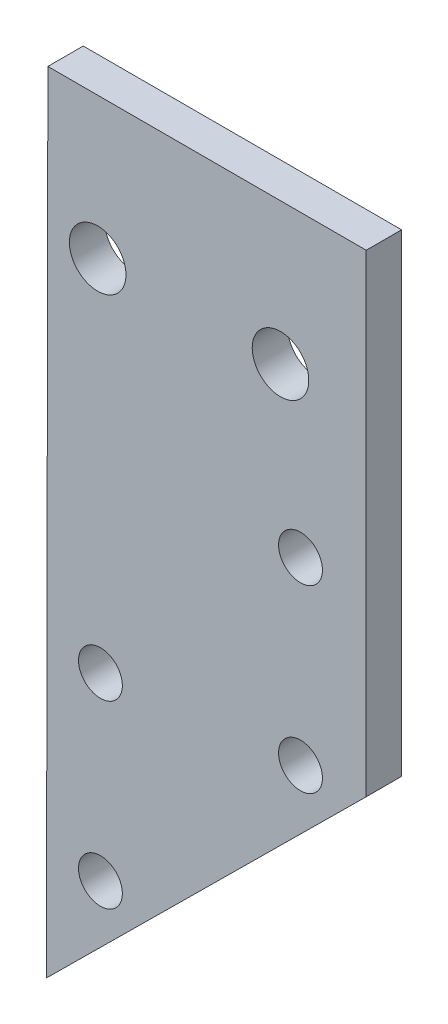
ISO-10303-21;
HEADER;
FILE_DESCRIPTION(('STEP AP214'),'2;1');
FILE_NAME('part.step','',(''),(''),'','','');
FILE_SCHEMA(('AUTOMOTIVE_DESIGN { 1 0 10303 214 1 1 1 1 }'));
ENDSEC;
DATA;
#1=APPLICATION_CONTEXT('core data for automotive mechanical design processes');
#2=APPLICATION_PROTOCOL_DEFINITION('international standard','automotive_design',2000,#1);
#3=PRODUCT_CONTEXT('',#1,'mechanical');
#4=PRODUCT('Part','Part','',(#3));
#5=PRODUCT_RELATED_PRODUCT_CATEGORY('part','',(#4));
#6=PRODUCT_DEFINITION_FORMATION('','',#4);
#7=PRODUCT_DEFINITION_CONTEXT('part definition',#1,'design');
#8=PRODUCT_DEFINITION('design','',#6,#7);
#9=PRODUCT_DEFINITION_SHAPE('','',#8);
#10=(LENGTH_UNIT() NAMED_UNIT(*) SI_UNIT(.MILLI.,.METRE.));
#11=(NAMED_UNIT(*) PLANE_ANGLE_UNIT() SI_UNIT($,.RADIAN.));
#12=(NAMED_UNIT(*) SI_UNIT($,.STERADIAN.) SOLID_ANGLE_UNIT());
#13=UNCERTAINTY_MEASURE_WITH_UNIT(LENGTH_MEASURE(1.E-05),#10,'distance_accuracy_value','');
#14=(GEOMETRIC_REPRESENTATION_CONTEXT(3) GLOBAL_UNCERTAINTY_ASSIGNED_CONTEXT((#13)) GLOBAL_UNIT_ASSIGNED_CONTEXT((#10,
#11,#12)) REPRESENTATION_CONTEXT('',''));
#15=CARTESIAN_POINT('',(0.,0.,0.));
#16=DIRECTION('',(0.,0.,1.));
#17=DIRECTION('',(1.,0.,0.));
#18=AXIS2_PLACEMENT_3D('',#15,#16,#17);
#19=CARTESIAN_POINT('',(0.,0.,0.));
#20=DIRECTION('',(0.,0.,1.));
#21=DIRECTION('',(1.,0.,0.));
#22=AXIS2_PLACEMENT_3D('',#19,#20,#21);
#23=PLANE('',#22);
#24=CARTESIAN_POINT('',(-142.668480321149,55.9735697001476,0.));
#25=DIRECTION('',(0.,0.,-1.));
#26=DIRECTION('',(-1.,0.,0.));
#27=AXIS2_PLACEMENT_3D('',#24,#25,#26);
#28=CIRCLE('',#27,3.09999999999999);
#29=CARTESIAN_POINT('',(-145.768480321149,55.9735697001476,0.));
#30=VERTEX_POINT('',#29);
#31=EDGE_CURVE('E99',#30,#30,#28,.F.);
#32=ORIENTED_EDGE('',*,*,#31,.T.);
#33=EDGE_LOOP('',(#32));
#34=FACE_BOUND('',#33,.T.);
#35=CARTESIAN_POINT('',(-170.952751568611,2.23345432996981,0.));
#36=DIRECTION('',(0.,0.,-1.));
#37=DIRECTION('',(-1.,0.,0.));
#38=AXIS2_PLACEMENT_3D('',#35,#36,#37);
#39=CIRCLE('',#38,3.09999999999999);
#40=CARTESIAN_POINT('',(-174.052751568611,2.23345432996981,0.));
#41=VERTEX_POINT('',#40);
#42=EDGE_CURVE('E102',#41,#41,#39,.F.);
#43=ORIENTED_EDGE('',*,*,#42,.T.);
#44=EDGE_LOOP('',(#43));
#45=FACE_BOUND('',#44,.T.);
#46=DIRECTION('',(-0.710399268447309,-0.703798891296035,0.));
#47=VECTOR('',#46,1.);
#48=CARTESIAN_POINT('',(-178.58737277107,-13.4664482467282,0.));
#49=LINE('',#48,#47);
#50=CARTESIAN_POINT('',(-133.382729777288,31.3181947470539,0.));
#51=VERTEX_POINT('',#50);
#52=CARTESIAN_POINT('',(-178.58737277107,-13.4664482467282,0.));
#53=VERTEX_POINT('',#52);
#54=EDGE_CURVE('E105',#51,#53,#49,.T.);
#55=ORIENTED_EDGE('',*,*,#54,.T.);
#56=DIRECTION('',(0.00183210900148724,0.999998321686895,0.));
#57=VECTOR('',#56,1.);
#58=CARTESIAN_POINT('',(-178.382729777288,98.2314093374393,0.));
#59=LINE('',#58,#57);
#60=CARTESIAN_POINT('',(-178.382729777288,98.2314093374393,0.));
#61=VERTEX_POINT('',#60);
#62=EDGE_CURVE('E72',#53,#61,#59,.T.);
#63=ORIENTED_EDGE('',*,*,#62,.T.);
#64=DIRECTION('',(1.,0.,0.));
#65=VECTOR('',#64,1.);
#66=CARTESIAN_POINT('',(-133.382729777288,98.2314093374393,0.));
#67=LINE('',#66,#65);
#68=CARTESIAN_POINT('',(-133.382729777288,98.2314093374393,0.));
#69=VERTEX_POINT('',#68);
#70=EDGE_CURVE('E55',#61,#69,#67,.T.);
#71=ORIENTED_EDGE('',*,*,#70,.T.);
#72=DIRECTION('',(0.,1.,0.));
#73=VECTOR('',#72,1.);
#74=CARTESIAN_POINT('',(-133.382729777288,31.3181947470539,0.));
#75=LINE('',#74,#73);
#76=EDGE_CURVE('E60',#69,#51,#75,.F.);
#77=ORIENTED_EDGE('',*,*,#76,.T.);
#78=EDGE_LOOP('',(#55,#63,#71,#77));
#79=FACE_BOUND('',#78,.T.);
#80=CARTESIAN_POINT('',(-170.952751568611,27.6892984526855,0.));
#81=DIRECTION('',(0.,0.,-1.));
#82=DIRECTION('',(-1.,0.,0.));
#83=AXIS2_PLACEMENT_3D('',#80,#81,#82);
#84=CIRCLE('',#83,3.09999999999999);
#85=CARTESIAN_POINT('',(-174.052751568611,27.6892984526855,0.));
#86=VERTEX_POINT('',#85);
#87=EDGE_CURVE('E69',#86,#86,#84,.F.);
#88=ORIENTED_EDGE('',*,*,#87,.T.);
#89=EDGE_LOOP('',(#88));
#90=FACE_BOUND('',#89,.T.);
#91=CARTESIAN_POINT('',(-142.668480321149,30.5177255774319,0.));
#92=DIRECTION('',(0.,0.,-1.));
#93=DIRECTION('',(-1.,0.,0.));
#94=AXIS2_PLACEMENT_3D('',#91,#92,#93);
#95=CIRCLE('',#94,3.09999999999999);
#96=CARTESIAN_POINT('',(-145.768480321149,30.5177255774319,0.));
#97=VERTEX_POINT('',#96);
#98=EDGE_CURVE('E108',#97,#97,#95,.F.);
#99=ORIENTED_EDGE('',*,*,#98,.T.);
#100=EDGE_LOOP('',(#99));
#101=FACE_BOUND('',#100,.T.);
#102=CARTESIAN_POINT('',(-171.341888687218,78.2314093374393,0.));
#103=DIRECTION('',(0.,0.,-1.));
#104=DIRECTION('',(-1.,0.,0.));
#105=AXIS2_PLACEMENT_3D('',#102,#103,#104);
#106=CIRCLE('',#105,4.);
#107=CARTESIAN_POINT('',(-175.341888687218,78.2314093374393,0.));
#108=VERTEX_POINT('',#107);
#109=EDGE_CURVE('E110',#108,#108,#106,.F.);
#110=ORIENTED_EDGE('',*,*,#109,.T.);
#111=EDGE_LOOP('',(#110));
#112=FACE_BOUND('',#111,.T.);
#113=CARTESIAN_POINT('',(-145.497823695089,78.2314093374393,0.));
#114=DIRECTION('',(0.,0.,-1.));
#115=DIRECTION('',(-1.,0.,0.));
#116=AXIS2_PLACEMENT_3D('',#113,#114,#115);
#117=CIRCLE('',#116,4.);
#118=CARTESIAN_POINT('',(-149.497823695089,78.2314093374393,0.));
#119=VERTEX_POINT('',#118);
#120=EDGE_CURVE('E20',#119,#119,#117,.F.);
#121=ORIENTED_EDGE('',*,*,#120,.T.);
#122=EDGE_LOOP('',(#121));
#123=FACE_BOUND('',#122,.T.);
#124=ADVANCED_FACE('F17',(#34,#45,#79,#90,#101,#112,#123),#23,.F.);
#125=CARTESIAN_POINT('',(-145.497823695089,78.2314093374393,5.));
#126=DIRECTION('',(0.,0.,-1.));
#127=DIRECTION('',(-1.,0.,0.));
#128=AXIS2_PLACEMENT_3D('',#125,#126,#127);
#129=CYLINDRICAL_SURFACE('',#128,4.);
#130=ORIENTED_EDGE('',*,*,#120,.F.);
#131=EDGE_LOOP('',(#130));
#132=FACE_BOUND('',#131,.T.);
#133=CARTESIAN_POINT('',(-145.497823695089,78.2314093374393,5.));
#134=DIRECTION('',(0.,0.,-1.));
#135=DIRECTION('',(-1.,0.,0.));
#136=AXIS2_PLACEMENT_3D('',#133,#134,#135);
#137=CIRCLE('',#136,4.);
#138=CARTESIAN_POINT('',(-149.497823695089,78.2314093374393,5.));
#139=VERTEX_POINT('',#138);
#140=EDGE_CURVE('E96',#139,#139,#137,.T.);
#141=ORIENTED_EDGE('',*,*,#140,.F.);
#142=EDGE_LOOP('',(#141));
#143=FACE_BOUND('',#142,.T.);
#144=ADVANCED_FACE('F118',(#132,#143),#129,.F.);
#145=CARTESIAN_POINT('',(-171.341888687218,78.2314093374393,5.));
#146=DIRECTION('',(0.,0.,-1.));
#147=DIRECTION('',(-1.,0.,0.));
#148=AXIS2_PLACEMENT_3D('',#145,#146,#147);
#149=CYLINDRICAL_SURFACE('',#148,4.);
#150=ORIENTED_EDGE('',*,*,#109,.F.);
#151=EDGE_LOOP('',(#150));
#152=FACE_BOUND('',#151,.T.);
#153=CARTESIAN_POINT('',(-171.341888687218,78.2314093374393,5.));
#154=DIRECTION('',(0.,0.,-1.));
#155=DIRECTION('',(-1.,0.,0.));
#156=AXIS2_PLACEMENT_3D('',#153,#154,#155);
#157=CIRCLE('',#156,4.);
#158=CARTESIAN_POINT('',(-175.341888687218,78.2314093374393,5.));
#159=VERTEX_POINT('',#158);
#160=EDGE_CURVE('E93',#159,#159,#157,.T.);
#161=ORIENTED_EDGE('',*,*,#160,.F.);
#162=EDGE_LOOP('',(#161));
#163=FACE_BOUND('',#162,.T.);
#164=ADVANCED_FACE('F121',(#152,#163),#149,.F.);
#165=CARTESIAN_POINT('',(-142.668480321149,30.5177255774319,5.));
#166=DIRECTION('',(0.,0.,-1.));
#167=DIRECTION('',(-1.,0.,0.));
#168=AXIS2_PLACEMENT_3D('',#165,#166,#167);
#169=CYLINDRICAL_SURFACE('',#168,3.09999999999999);
#170=CARTESIAN_POINT('',(-142.668480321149,30.5177255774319,5.));
#171=DIRECTION('',(0.,0.,-1.));
#172=DIRECTION('',(-1.,0.,0.));
#173=AXIS2_PLACEMENT_3D('',#170,#171,#172);
#174=CIRCLE('',#173,3.09999999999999);
#175=CARTESIAN_POINT('',(-145.768480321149,30.5177255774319,5.));
#176=VERTEX_POINT('',#175);
#177=EDGE_CURVE('E90',#176,#176,#174,.T.);
#178=ORIENTED_EDGE('',*,*,#177,.F.);
#179=EDGE_LOOP('',(#178));
#180=FACE_BOUND('',#179,.T.);
#181=ORIENTED_EDGE('',*,*,#98,.F.);
#182=EDGE_LOOP('',(#181));
#183=FACE_BOUND('',#182,.T.);
#184=ADVANCED_FACE('F155',(#180,#183),#169,.F.);
#185=CARTESIAN_POINT('',(-170.952751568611,27.6892984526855,5.));
#186=DIRECTION('',(0.,0.,-1.));
#187=DIRECTION('',(-1.,0.,0.));
#188=AXIS2_PLACEMENT_3D('',#185,#186,#187);
#189=CYLINDRICAL_SURFACE('',#188,3.09999999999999);
#190=CARTESIAN_POINT('',(-170.952751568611,27.6892984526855,5.));
#191=DIRECTION('',(0.,0.,-1.));
#192=DIRECTION('',(-1.,0.,0.));
#193=AXIS2_PLACEMENT_3D('',#190,#191,#192);
#194=CIRCLE('',#193,3.09999999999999);
#195=CARTESIAN_POINT('',(-174.052751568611,27.6892984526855,5.));
#196=VERTEX_POINT('',#195);
#197=EDGE_CURVE('E86',#196,#196,#194,.T.);
#198=ORIENTED_EDGE('',*,*,#197,.F.);
#199=EDGE_LOOP('',(#198));
#200=FACE_BOUND('',#199,.T.);
#201=ORIENTED_EDGE('',*,*,#87,.F.);
#202=EDGE_LOOP('',(#201));
#203=FACE_BOUND('',#202,.T.);
#204=ADVANCED_FACE('F152',(#200,#203),#189,.F.);
#205=CARTESIAN_POINT('',(-133.382729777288,31.3181947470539,5.));
#206=DIRECTION('',(-1.,0.,0.));
#207=DIRECTION('',(0.,0.,1.));
#208=AXIS2_PLACEMENT_3D('',#205,#206,#207);
#209=PLANE('',#208);
#210=DIRECTION('',(0.,0.,-1.));
#211=VECTOR('',#210,1.);
#212=CARTESIAN_POINT('',(-133.382729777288,98.2314093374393,5.));
#213=LINE('',#212,#211);
#214=CARTESIAN_POINT('',(-133.382729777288,98.2314093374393,5.));
#215=VERTEX_POINT('',#214);
#216=EDGE_CURVE('E62',#69,#215,#213,.F.);
#217=ORIENTED_EDGE('',*,*,#216,.T.);
#218=DIRECTION('',(0.,1.,0.));
#219=VECTOR('',#218,1.);
#220=CARTESIAN_POINT('',(-133.382729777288,0.,5.));
#221=LINE('',#220,#219);
#222=CARTESIAN_POINT('',(-133.382729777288,31.3181947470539,5.));
#223=VERTEX_POINT('',#222);
#224=EDGE_CURVE('E89',#223,#215,#221,.T.);
#225=ORIENTED_EDGE('',*,*,#224,.F.);
#226=DIRECTION('',(0.,0.,1.));
#227=VECTOR('',#226,1.);
#228=CARTESIAN_POINT('',(-133.382729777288,31.3181947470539,5.));
#229=LINE('',#228,#227);
#230=EDGE_CURVE('E65',#223,#51,#229,.F.);
#231=ORIENTED_EDGE('',*,*,#230,.T.);
#232=ORIENTED_EDGE('',*,*,#76,.F.);
#233=EDGE_LOOP('',(#217,#225,#231,#232));
#234=FACE_BOUND('',#233,.T.);
#235=ADVANCED_FACE('F61',(#234),#209,.F.);
#236=CARTESIAN_POINT('',(-133.382729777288,98.2314093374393,5.));
#237=DIRECTION('',(0.,-1.,0.));
#238=DIRECTION('',(0.,0.,-1.));
#239=AXIS2_PLACEMENT_3D('',#236,#237,#238);
#240=PLANE('',#239);
#241=DIRECTION('',(0.,0.,1.));
#242=VECTOR('',#241,1.);
#243=CARTESIAN_POINT('',(-178.382729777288,98.2314093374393,5.));
#244=LINE('',#243,#242);
#245=CARTESIAN_POINT('',(-178.382729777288,98.2314093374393,5.));
#246=VERTEX_POINT('',#245);
#247=EDGE_CURVE('E74',#61,#246,#244,.T.);
#248=ORIENTED_EDGE('',*,*,#247,.T.);
#249=DIRECTION('',(1.,0.,0.));
#250=VECTOR('',#249,1.);
#251=CARTESIAN_POINT('',(0.,98.2314093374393,5.));
#252=LINE('',#251,#250);
#253=EDGE_CURVE('E78',#215,#246,#252,.F.);
#254=ORIENTED_EDGE('',*,*,#253,.F.);
#255=ORIENTED_EDGE('',*,*,#216,.F.);
#256=ORIENTED_EDGE('',*,*,#70,.F.);
#257=EDGE_LOOP('',(#248,#254,#255,#256));
#258=FACE_BOUND('',#257,.T.);
#259=ADVANCED_FACE('F76',(#258),#240,.F.);
#260=CARTESIAN_POINT('',(-178.382729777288,98.2314093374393,5.));
#261=DIRECTION('',(0.999998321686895,-0.00183210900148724,0.));
#262=DIRECTION('',(0.00183210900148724,0.999998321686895,0.));
#263=AXIS2_PLACEMENT_3D('',#260,#261,#262);
#264=PLANE('',#263);
#265=DIRECTION('',(0.,0.,1.));
#266=VECTOR('',#265,1.);
#267=CARTESIAN_POINT('',(-178.58737277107,-13.4664482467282,5.));
#268=LINE('',#267,#266);
#269=CARTESIAN_POINT('',(-178.58737277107,-13.4664482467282,5.));
#270=VERTEX_POINT('',#269);
#271=EDGE_CURVE('E35',#53,#270,#268,.T.);
#272=ORIENTED_EDGE('',*,*,#271,.T.);
#273=DIRECTION('',(-0.00183210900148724,-0.999998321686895,0.));
#274=VECTOR('',#273,1.);
#275=CARTESIAN_POINT('',(-178.382729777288,98.2314093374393,5.));
#276=LINE('',#275,#274);
#277=EDGE_CURVE('E262',#246,#270,#276,.T.);
#278=ORIENTED_EDGE('',*,*,#277,.F.);
#279=ORIENTED_EDGE('',*,*,#247,.F.);
#280=ORIENTED_EDGE('',*,*,#62,.F.);
#281=EDGE_LOOP('',(#272,#278,#279,#280));
#282=FACE_BOUND('',#281,.T.);
#283=ADVANCED_FACE('F144',(#282),#264,.F.);
#284=CARTESIAN_POINT('',(-178.58737277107,-13.4664482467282,5.));
#285=DIRECTION('',(-0.703798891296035,0.710399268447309,0.));
#286=DIRECTION('',(-0.710399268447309,-0.703798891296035,0.));
#287=AXIS2_PLACEMENT_3D('',#284,#285,#286);
#288=PLANE('',#287);
#289=ORIENTED_EDGE('',*,*,#230,.F.);
#290=DIRECTION('',(0.710399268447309,0.703798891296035,0.));
#291=VECTOR('',#290,1.);
#292=CARTESIAN_POINT('',(-178.58737277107,-13.4664482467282,5.));
#293=LINE('',#292,#291);
#294=EDGE_CURVE('E85',#270,#223,#293,.T.);
#295=ORIENTED_EDGE('',*,*,#294,.F.);
#296=ORIENTED_EDGE('',*,*,#271,.F.);
#297=ORIENTED_EDGE('',*,*,#54,.F.);
#298=EDGE_LOOP('',(#289,#295,#296,#297));
#299=FACE_BOUND('',#298,.T.);
#300=ADVANCED_FACE('F140',(#299),#288,.F.);
#301=CARTESIAN_POINT('',(-170.952751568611,2.23345432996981,5.));
#302=DIRECTION('',(0.,0.,-1.));
#303=DIRECTION('',(-1.,0.,0.));
#304=AXIS2_PLACEMENT_3D('',#301,#302,#303);
#305=CYLINDRICAL_SURFACE('',#304,3.09999999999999);
#306=CARTESIAN_POINT('',(-170.952751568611,2.23345432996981,5.));
#307=DIRECTION('',(0.,0.,-1.));
#308=DIRECTION('',(-1.,0.,0.));
#309=AXIS2_PLACEMENT_3D('',#306,#307,#308);
#310=CIRCLE('',#309,3.09999999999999);
#311=CARTESIAN_POINT('',(-174.052751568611,2.23345432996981,5.));
#312=VERTEX_POINT('',#311);
#313=EDGE_CURVE('E26',#312,#312,#310,.T.);
#314=ORIENTED_EDGE('',*,*,#313,.F.);
#315=EDGE_LOOP('',(#314));
#316=FACE_BOUND('',#315,.T.);
#317=ORIENTED_EDGE('',*,*,#42,.F.);
#318=EDGE_LOOP('',(#317));
#319=FACE_BOUND('',#318,.T.);
#320=ADVANCED_FACE('F133',(#316,#319),#305,.F.);
#321=CARTESIAN_POINT('',(-142.668480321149,55.9735697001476,5.));
#322=DIRECTION('',(0.,0.,-1.));
#323=DIRECTION('',(-1.,0.,0.));
#324=AXIS2_PLACEMENT_3D('',#321,#322,#323);
#325=CYLINDRICAL_SURFACE('',#324,3.09999999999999);
#326=CARTESIAN_POINT('',(-142.668480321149,55.9735697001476,5.));
#327=DIRECTION('',(0.,0.,-1.));
#328=DIRECTION('',(-1.,0.,0.));
#329=AXIS2_PLACEMENT_3D('',#326,#327,#328);
#330=CIRCLE('',#329,3.09999999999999);
#331=CARTESIAN_POINT('',(-145.768480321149,55.9735697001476,5.));
#332=VERTEX_POINT('',#331);
#333=EDGE_CURVE('E11',#332,#332,#330,.T.);
#334=ORIENTED_EDGE('',*,*,#333,.F.);
#335=EDGE_LOOP('',(#334));
#336=FACE_BOUND('',#335,.T.);
#337=ORIENTED_EDGE('',*,*,#31,.F.);
#338=EDGE_LOOP('',(#337));
#339=FACE_BOUND('',#338,.T.);
#340=ADVANCED_FACE('F126',(#336,#339),#325,.F.);
#341=CARTESIAN_POINT('',(0.,0.,5.));
#342=DIRECTION('',(0.,0.,1.));
#343=DIRECTION('',(1.,0.,0.));
#344=AXIS2_PLACEMENT_3D('',#341,#342,#343);
#345=PLANE('',#344);
#346=ORIENTED_EDGE('',*,*,#333,.T.);
#347=EDGE_LOOP('',(#346));
#348=FACE_BOUND('',#347,.T.);
#349=ORIENTED_EDGE('',*,*,#313,.T.);
#350=EDGE_LOOP('',(#349));
#351=FACE_BOUND('',#350,.T.);
#352=ORIENTED_EDGE('',*,*,#277,.T.);
#353=ORIENTED_EDGE('',*,*,#294,.T.);
#354=ORIENTED_EDGE('',*,*,#224,.T.);
#355=ORIENTED_EDGE('',*,*,#253,.T.);
#356=EDGE_LOOP('',(#352,#353,#354,#355));
#357=FACE_BOUND('',#356,.T.);
#358=ORIENTED_EDGE('',*,*,#197,.T.);
#359=EDGE_LOOP('',(#358));
#360=FACE_BOUND('',#359,.T.);
#361=ORIENTED_EDGE('',*,*,#177,.T.);
#362=EDGE_LOOP('',(#361));
#363=FACE_BOUND('',#362,.T.);
#364=ORIENTED_EDGE('',*,*,#160,.T.);
#365=EDGE_LOOP('',(#364));
#366=FACE_BOUND('',#365,.T.);
#367=ORIENTED_EDGE('',*,*,#140,.T.);
#368=EDGE_LOOP('',(#367));
#369=FACE_BOUND('',#368,.T.);
#370=ADVANCED_FACE('F124',(#348,#351,#357,#360,#363,#366,#369),#345,.T.);
#371=CLOSED_SHELL('',(#124,#144,#164,#184,#204,#235,#259,#283,#300,#320,#340,#370));
#372=MANIFOLD_SOLID_BREP('B1',#371);
#373=ADVANCED_BREP_SHAPE_REPRESENTATION('',(#18,#372),#14);
#374=SHAPE_DEFINITION_REPRESENTATION(#9,#373);
ENDSEC;
END-ISO-10303-21;
